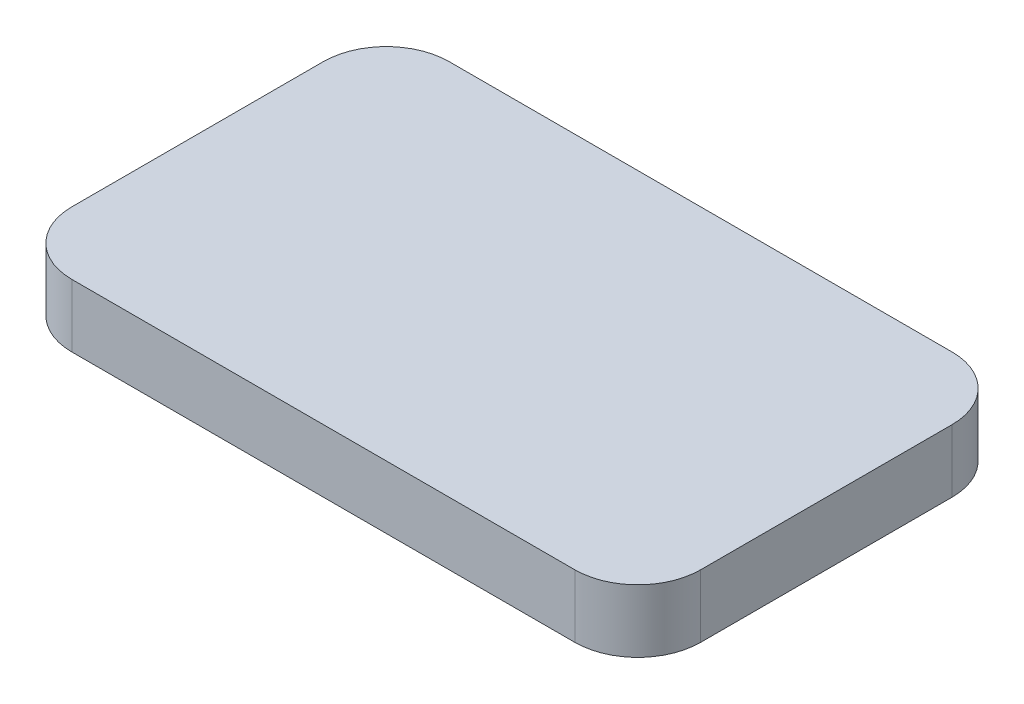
ISO-10303-21;
HEADER;
FILE_DESCRIPTION(('STEP AP214'),'2;1');
FILE_NAME('part.step','',(''),(''),'','','');
FILE_SCHEMA(('AUTOMOTIVE_DESIGN { 1 0 10303 214 1 1 1 1 }'));
ENDSEC;
DATA;
#1=APPLICATION_CONTEXT('core data for automotive mechanical design processes');
#2=APPLICATION_PROTOCOL_DEFINITION('international standard','automotive_design',2000,#1);
#3=PRODUCT_CONTEXT('',#1,'mechanical');
#4=PRODUCT('Part','Part','',(#3));
#5=PRODUCT_RELATED_PRODUCT_CATEGORY('part','',(#4));
#6=PRODUCT_DEFINITION_FORMATION('','',#4);
#7=PRODUCT_DEFINITION_CONTEXT('part definition',#1,'design');
#8=PRODUCT_DEFINITION('design','',#6,#7);
#9=PRODUCT_DEFINITION_SHAPE('','',#8);
#10=(LENGTH_UNIT() NAMED_UNIT(*) SI_UNIT(.MILLI.,.METRE.));
#11=(NAMED_UNIT(*) PLANE_ANGLE_UNIT() SI_UNIT($,.RADIAN.));
#12=(NAMED_UNIT(*) SI_UNIT($,.STERADIAN.) SOLID_ANGLE_UNIT());
#13=UNCERTAINTY_MEASURE_WITH_UNIT(LENGTH_MEASURE(1.E-05),#10,'distance_accuracy_value','');
#14=(GEOMETRIC_REPRESENTATION_CONTEXT(3) GLOBAL_UNCERTAINTY_ASSIGNED_CONTEXT((#13)) GLOBAL_UNIT_ASSIGNED_CONTEXT((#10,
#11,#12)) REPRESENTATION_CONTEXT('',''));
#15=CARTESIAN_POINT('',(0.,0.,0.));
#16=DIRECTION('',(0.,0.,1.));
#17=DIRECTION('',(1.,0.,0.));
#18=AXIS2_PLACEMENT_3D('',#15,#16,#17);
#19=CARTESIAN_POINT('',(-50.,10.,30.));
#20=DIRECTION('',(1.,0.,0.));
#21=DIRECTION('',(0.,0.,-1.));
#22=AXIS2_PLACEMENT_3D('',#19,#20,#21);
#23=PLANE('',#22);
#24=DIRECTION('',(0.,0.,1.));
#25=VECTOR('',#24,1.);
#26=CARTESIAN_POINT('',(-50.,10.,30.));
#27=LINE('',#26,#25);
#28=CARTESIAN_POINT('',(-50.,10.,-20.));
#29=VERTEX_POINT('',#28);
#30=CARTESIAN_POINT('',(-50.,10.,20.));
#31=VERTEX_POINT('',#30);
#32=EDGE_CURVE('E118',#29,#31,#27,.T.);
#33=ORIENTED_EDGE('',*,*,#32,.F.);
#34=DIRECTION('',(0.,-1.,0.));
#35=VECTOR('',#34,1.);
#36=CARTESIAN_POINT('',(-50.,10.,-20.));
#37=LINE('',#36,#35);
#38=CARTESIAN_POINT('',(-50.,0.,-20.));
#39=VERTEX_POINT('',#38);
#40=EDGE_CURVE('E103',#29,#39,#37,.T.);
#41=ORIENTED_EDGE('',*,*,#40,.T.);
#42=DIRECTION('',(0.,0.,1.));
#43=VECTOR('',#42,1.);
#44=CARTESIAN_POINT('',(-50.,0.,30.));
#45=LINE('',#44,#43);
#46=CARTESIAN_POINT('',(-50.,0.,20.));
#47=VERTEX_POINT('',#46);
#48=EDGE_CURVE('E115',#39,#47,#45,.T.);
#49=ORIENTED_EDGE('',*,*,#48,.T.);
#50=DIRECTION('',(0.,-1.,0.));
#51=VECTOR('',#50,1.);
#52=CARTESIAN_POINT('',(-50.,10.,20.));
#53=LINE('',#52,#51);
#54=EDGE_CURVE('E120',#47,#31,#53,.F.);
#55=ORIENTED_EDGE('',*,*,#54,.T.);
#56=EDGE_LOOP('',(#33,#41,#49,#55));
#57=FACE_BOUND('',#56,.T.);
#58=ADVANCED_FACE('F33',(#57),#23,.F.);
#59=CARTESIAN_POINT('',(50.,10.,30.));
#60=DIRECTION('',(0.,0.,-1.));
#61=DIRECTION('',(-1.,0.,0.));
#62=AXIS2_PLACEMENT_3D('',#59,#60,#61);
#63=PLANE('',#62);
#64=DIRECTION('',(1.,0.,0.));
#65=VECTOR('',#64,1.);
#66=CARTESIAN_POINT('',(50.,0.,30.));
#67=LINE('',#66,#65);
#68=CARTESIAN_POINT('',(-40.,0.,30.));
#69=VERTEX_POINT('',#68);
#70=CARTESIAN_POINT('',(40.,0.,30.));
#71=VERTEX_POINT('',#70);
#72=EDGE_CURVE('E124',#69,#71,#67,.T.);
#73=ORIENTED_EDGE('',*,*,#72,.T.);
#74=DIRECTION('',(0.,-1.,0.));
#75=VECTOR('',#74,1.);
#76=CARTESIAN_POINT('',(40.,10.,30.));
#77=LINE('',#76,#75);
#78=CARTESIAN_POINT('',(40.,10.,30.));
#79=VERTEX_POINT('',#78);
#80=EDGE_CURVE('E11',#71,#79,#77,.F.);
#81=ORIENTED_EDGE('',*,*,#80,.T.);
#82=DIRECTION('',(1.,0.,0.));
#83=VECTOR('',#82,1.);
#84=CARTESIAN_POINT('',(50.,10.,30.));
#85=LINE('',#84,#83);
#86=CARTESIAN_POINT('',(-40.,10.,30.));
#87=VERTEX_POINT('',#86);
#88=EDGE_CURVE('E160',#87,#79,#85,.T.);
#89=ORIENTED_EDGE('',*,*,#88,.F.);
#90=DIRECTION('',(0.,-1.,0.));
#91=VECTOR('',#90,1.);
#92=CARTESIAN_POINT('',(-40.,10.,30.));
#93=LINE('',#92,#91);
#94=EDGE_CURVE('E41',#87,#69,#93,.T.);
#95=ORIENTED_EDGE('',*,*,#94,.T.);
#96=EDGE_LOOP('',(#73,#81,#89,#95));
#97=FACE_BOUND('',#96,.T.);
#98=ADVANCED_FACE('F158',(#97),#63,.F.);
#99=CARTESIAN_POINT('',(50.,10.,30.));
#100=DIRECTION('',(-1.,0.,0.));
#101=DIRECTION('',(0.,0.,1.));
#102=AXIS2_PLACEMENT_3D('',#99,#100,#101);
#103=PLANE('',#102);
#104=DIRECTION('',(0.,0.,-1.));
#105=VECTOR('',#104,1.);
#106=CARTESIAN_POINT('',(50.,0.,30.));
#107=LINE('',#106,#105);
#108=CARTESIAN_POINT('',(50.,0.,20.));
#109=VERTEX_POINT('',#108);
#110=CARTESIAN_POINT('',(50.,0.,-20.));
#111=VERTEX_POINT('',#110);
#112=EDGE_CURVE('E127',#109,#111,#107,.T.);
#113=ORIENTED_EDGE('',*,*,#112,.T.);
#114=DIRECTION('',(0.,-1.,0.));
#115=VECTOR('',#114,1.);
#116=CARTESIAN_POINT('',(50.,10.,-20.));
#117=LINE('',#116,#115);
#118=CARTESIAN_POINT('',(50.,10.,-20.));
#119=VERTEX_POINT('',#118);
#120=EDGE_CURVE('E48',#111,#119,#117,.F.);
#121=ORIENTED_EDGE('',*,*,#120,.T.);
#122=DIRECTION('',(0.,0.,-1.));
#123=VECTOR('',#122,1.);
#124=CARTESIAN_POINT('',(50.,10.,30.));
#125=LINE('',#124,#123);
#126=CARTESIAN_POINT('',(50.,10.,20.));
#127=VERTEX_POINT('',#126);
#128=EDGE_CURVE('E168',#127,#119,#125,.T.);
#129=ORIENTED_EDGE('',*,*,#128,.F.);
#130=DIRECTION('',(0.,-1.,0.));
#131=VECTOR('',#130,1.);
#132=CARTESIAN_POINT('',(50.,10.,20.));
#133=LINE('',#132,#131);
#134=EDGE_CURVE('E151',#127,#109,#133,.T.);
#135=ORIENTED_EDGE('',*,*,#134,.T.);
#136=EDGE_LOOP('',(#113,#121,#129,#135));
#137=FACE_BOUND('',#136,.T.);
#138=ADVANCED_FACE('F167',(#137),#103,.F.);
#139=CARTESIAN_POINT('',(50.,10.,-30.));
#140=DIRECTION('',(0.,0.,1.));
#141=DIRECTION('',(1.,0.,0.));
#142=AXIS2_PLACEMENT_3D('',#139,#140,#141);
#143=PLANE('',#142);
#144=DIRECTION('',(-1.,0.,0.));
#145=VECTOR('',#144,1.);
#146=CARTESIAN_POINT('',(50.,0.,-30.));
#147=LINE('',#146,#145);
#148=CARTESIAN_POINT('',(40.,0.,-30.));
#149=VERTEX_POINT('',#148);
#150=CARTESIAN_POINT('',(-40.,0.,-30.));
#151=VERTEX_POINT('',#150);
#152=EDGE_CURVE('E134',#149,#151,#147,.T.);
#153=ORIENTED_EDGE('',*,*,#152,.T.);
#154=DIRECTION('',(0.,-1.,0.));
#155=VECTOR('',#154,1.);
#156=CARTESIAN_POINT('',(-40.,10.,-30.));
#157=LINE('',#156,#155);
#158=CARTESIAN_POINT('',(-40.,10.,-30.));
#159=VERTEX_POINT('',#158);
#160=EDGE_CURVE('E104',#151,#159,#157,.F.);
#161=ORIENTED_EDGE('',*,*,#160,.T.);
#162=DIRECTION('',(-1.,0.,0.));
#163=VECTOR('',#162,1.);
#164=CARTESIAN_POINT('',(50.,10.,-30.));
#165=LINE('',#164,#163);
#166=CARTESIAN_POINT('',(40.,10.,-30.));
#167=VERTEX_POINT('',#166);
#168=EDGE_CURVE('E130',#167,#159,#165,.T.);
#169=ORIENTED_EDGE('',*,*,#168,.F.);
#170=DIRECTION('',(0.,-1.,0.));
#171=VECTOR('',#170,1.);
#172=CARTESIAN_POINT('',(40.,10.,-30.));
#173=LINE('',#172,#171);
#174=EDGE_CURVE('E109',#167,#149,#173,.T.);
#175=ORIENTED_EDGE('',*,*,#174,.T.);
#176=EDGE_LOOP('',(#153,#161,#169,#175));
#177=FACE_BOUND('',#176,.T.);
#178=ADVANCED_FACE('F196',(#177),#143,.F.);
#179=CARTESIAN_POINT('',(0.,10.,0.));
#180=DIRECTION('',(0.,1.,0.));
#181=DIRECTION('',(0.,0.,1.));
#182=AXIS2_PLACEMENT_3D('',#179,#180,#181);
#183=PLANE('',#182);
#184=ORIENTED_EDGE('',*,*,#168,.T.);
#185=CARTESIAN_POINT('',(-40.,10.,-20.));
#186=DIRECTION('',(0.,1.,0.));
#187=DIRECTION('',(0.,0.,1.));
#188=AXIS2_PLACEMENT_3D('',#185,#186,#187);
#189=CIRCLE('',#188,10.);
#190=EDGE_CURVE('E149',#159,#29,#189,.T.);
#191=ORIENTED_EDGE('',*,*,#190,.T.);
#192=ORIENTED_EDGE('',*,*,#32,.T.);
#193=CARTESIAN_POINT('',(-40.,10.,20.));
#194=DIRECTION('',(0.,1.,0.));
#195=DIRECTION('',(0.,0.,1.));
#196=AXIS2_PLACEMENT_3D('',#193,#194,#195);
#197=CIRCLE('',#196,10.);
#198=EDGE_CURVE('E144',#31,#87,#197,.T.);
#199=ORIENTED_EDGE('',*,*,#198,.T.);
#200=ORIENTED_EDGE('',*,*,#88,.T.);
#201=CARTESIAN_POINT('',(40.,10.,20.));
#202=DIRECTION('',(0.,1.,0.));
#203=DIRECTION('',(0.,0.,1.));
#204=AXIS2_PLACEMENT_3D('',#201,#202,#203);
#205=CIRCLE('',#204,10.);
#206=EDGE_CURVE('E55',#79,#127,#205,.T.);
#207=ORIENTED_EDGE('',*,*,#206,.T.);
#208=ORIENTED_EDGE('',*,*,#128,.T.);
#209=CARTESIAN_POINT('',(40.,10.,-20.));
#210=DIRECTION('',(0.,1.,0.));
#211=DIRECTION('',(0.,0.,1.));
#212=AXIS2_PLACEMENT_3D('',#209,#210,#211);
#213=CIRCLE('',#212,10.);
#214=EDGE_CURVE('E147',#119,#167,#213,.T.);
#215=ORIENTED_EDGE('',*,*,#214,.T.);
#216=EDGE_LOOP('',(#184,#191,#192,#199,#200,#207,#208,#215));
#217=FACE_BOUND('',#216,.T.);
#218=ADVANCED_FACE('F173',(#217),#183,.T.);
#219=CARTESIAN_POINT('',(0.,0.,0.));
#220=DIRECTION('',(0.,1.,0.));
#221=DIRECTION('',(0.,0.,1.));
#222=AXIS2_PLACEMENT_3D('',#219,#220,#221);
#223=PLANE('',#222);
#224=ORIENTED_EDGE('',*,*,#48,.F.);
#225=CARTESIAN_POINT('',(-40.,0.,-20.));
#226=DIRECTION('',(0.,1.,0.));
#227=DIRECTION('',(0.,0.,1.));
#228=AXIS2_PLACEMENT_3D('',#225,#226,#227);
#229=CIRCLE('',#228,10.);
#230=EDGE_CURVE('E99',#39,#151,#229,.F.);
#231=ORIENTED_EDGE('',*,*,#230,.T.);
#232=ORIENTED_EDGE('',*,*,#152,.F.);
#233=CARTESIAN_POINT('',(40.,0.,-20.));
#234=DIRECTION('',(0.,1.,0.));
#235=DIRECTION('',(0.,0.,1.));
#236=AXIS2_PLACEMENT_3D('',#233,#234,#235);
#237=CIRCLE('',#236,10.);
#238=EDGE_CURVE('E110',#149,#111,#237,.F.);
#239=ORIENTED_EDGE('',*,*,#238,.T.);
#240=ORIENTED_EDGE('',*,*,#112,.F.);
#241=CARTESIAN_POINT('',(40.,0.,20.));
#242=DIRECTION('',(0.,1.,0.));
#243=DIRECTION('',(0.,0.,1.));
#244=AXIS2_PLACEMENT_3D('',#241,#242,#243);
#245=CIRCLE('',#244,10.);
#246=EDGE_CURVE('E138',#109,#71,#245,.F.);
#247=ORIENTED_EDGE('',*,*,#246,.T.);
#248=ORIENTED_EDGE('',*,*,#72,.F.);
#249=CARTESIAN_POINT('',(-40.,0.,20.));
#250=DIRECTION('',(0.,1.,0.));
#251=DIRECTION('',(0.,0.,1.));
#252=AXIS2_PLACEMENT_3D('',#249,#250,#251);
#253=CIRCLE('',#252,10.);
#254=EDGE_CURVE('E119',#69,#47,#253,.F.);
#255=ORIENTED_EDGE('',*,*,#254,.T.);
#256=EDGE_LOOP('',(#224,#231,#232,#239,#240,#247,#248,#255));
#257=FACE_BOUND('',#256,.T.);
#258=ADVANCED_FACE('F122',(#257),#223,.F.);
#259=CARTESIAN_POINT('',(-40.,10.,-20.));
#260=DIRECTION('',(0.,-1.,0.));
#261=DIRECTION('',(0.,0.,-1.));
#262=AXIS2_PLACEMENT_3D('',#259,#260,#261);
#263=CYLINDRICAL_SURFACE('',#262,10.);
#264=ORIENTED_EDGE('',*,*,#190,.F.);
#265=ORIENTED_EDGE('',*,*,#160,.F.);
#266=ORIENTED_EDGE('',*,*,#230,.F.);
#267=ORIENTED_EDGE('',*,*,#40,.F.);
#268=EDGE_LOOP('',(#264,#265,#266,#267));
#269=FACE_BOUND('',#268,.T.);
#270=ADVANCED_FACE('F102',(#269),#263,.T.);
#271=CARTESIAN_POINT('',(40.,10.,-20.));
#272=DIRECTION('',(0.,-1.,0.));
#273=DIRECTION('',(0.,0.,-1.));
#274=AXIS2_PLACEMENT_3D('',#271,#272,#273);
#275=CYLINDRICAL_SURFACE('',#274,10.);
#276=ORIENTED_EDGE('',*,*,#214,.F.);
#277=ORIENTED_EDGE('',*,*,#120,.F.);
#278=ORIENTED_EDGE('',*,*,#238,.F.);
#279=ORIENTED_EDGE('',*,*,#174,.F.);
#280=EDGE_LOOP('',(#276,#277,#278,#279));
#281=FACE_BOUND('',#280,.T.);
#282=ADVANCED_FACE('F178',(#281),#275,.T.);
#283=CARTESIAN_POINT('',(40.,10.,20.));
#284=DIRECTION('',(0.,-1.,0.));
#285=DIRECTION('',(0.,0.,-1.));
#286=AXIS2_PLACEMENT_3D('',#283,#284,#285);
#287=CYLINDRICAL_SURFACE('',#286,10.);
#288=ORIENTED_EDGE('',*,*,#206,.F.);
#289=ORIENTED_EDGE('',*,*,#80,.F.);
#290=ORIENTED_EDGE('',*,*,#246,.F.);
#291=ORIENTED_EDGE('',*,*,#134,.F.);
#292=EDGE_LOOP('',(#288,#289,#290,#291));
#293=FACE_BOUND('',#292,.T.);
#294=ADVANCED_FACE('F166',(#293),#287,.T.);
#295=CARTESIAN_POINT('',(-40.,10.,20.));
#296=DIRECTION('',(0.,-1.,0.));
#297=DIRECTION('',(0.,0.,-1.));
#298=AXIS2_PLACEMENT_3D('',#295,#296,#297);
#299=CYLINDRICAL_SURFACE('',#298,10.);
#300=ORIENTED_EDGE('',*,*,#198,.F.);
#301=ORIENTED_EDGE('',*,*,#54,.F.);
#302=ORIENTED_EDGE('',*,*,#254,.F.);
#303=ORIENTED_EDGE('',*,*,#94,.F.);
#304=EDGE_LOOP('',(#300,#301,#302,#303));
#305=FACE_BOUND('',#304,.T.);
#306=ADVANCED_FACE('F35',(#305),#299,.T.);
#307=CLOSED_SHELL('',(#58,#98,#138,#178,#218,#258,#270,#282,#294,#306));
#308=MANIFOLD_SOLID_BREP('B2',#307);
#309=ADVANCED_BREP_SHAPE_REPRESENTATION('',(#18,#308),#14);
#310=SHAPE_DEFINITION_REPRESENTATION(#9,#309);
ENDSEC;
END-ISO-10303-21;
